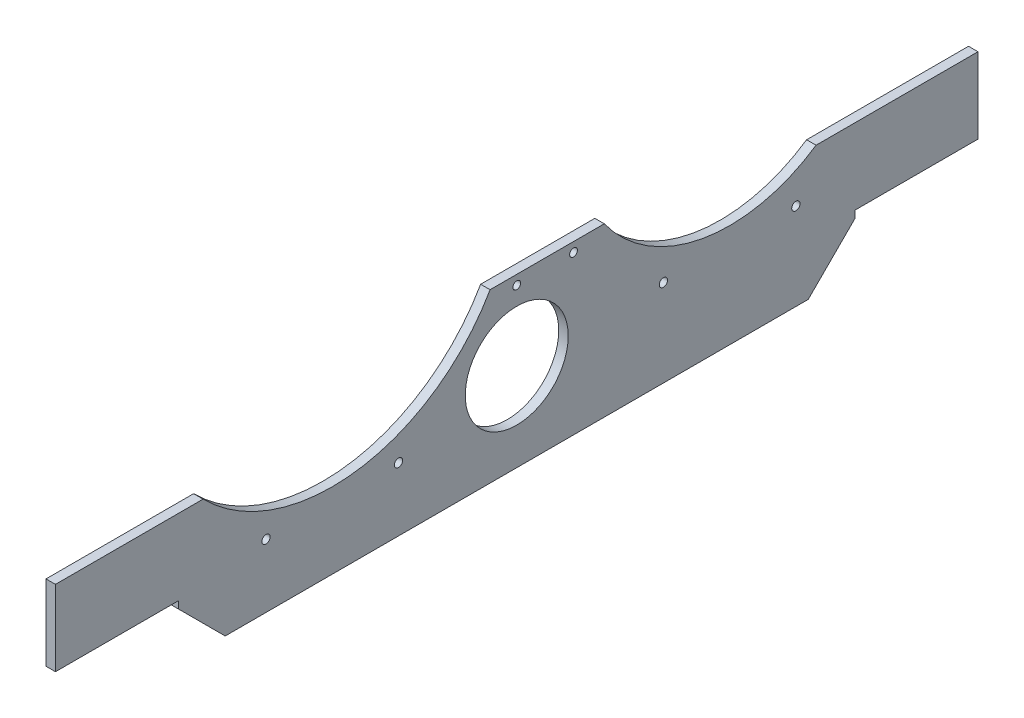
ISO-10303-21;
HEADER;
FILE_DESCRIPTION(('STEP AP214'),'2;1');
FILE_NAME('part.step','',(''),(''),'','','');
FILE_SCHEMA(('AUTOMOTIVE_DESIGN { 1 0 10303 214 1 1 1 1 }'));
ENDSEC;
DATA;
#1=APPLICATION_CONTEXT('core data for automotive mechanical design processes');
#2=APPLICATION_PROTOCOL_DEFINITION('international standard','automotive_design',2000,#1);
#3=PRODUCT_CONTEXT('',#1,'mechanical');
#4=PRODUCT('Part','Part','',(#3));
#5=PRODUCT_RELATED_PRODUCT_CATEGORY('part','',(#4));
#6=PRODUCT_DEFINITION_FORMATION('','',#4);
#7=PRODUCT_DEFINITION_CONTEXT('part definition',#1,'design');
#8=PRODUCT_DEFINITION('design','',#6,#7);
#9=PRODUCT_DEFINITION_SHAPE('','',#8);
#10=(LENGTH_UNIT() NAMED_UNIT(*) SI_UNIT(.MILLI.,.METRE.));
#11=(NAMED_UNIT(*) PLANE_ANGLE_UNIT() SI_UNIT($,.RADIAN.));
#12=(NAMED_UNIT(*) SI_UNIT($,.STERADIAN.) SOLID_ANGLE_UNIT());
#13=UNCERTAINTY_MEASURE_WITH_UNIT(LENGTH_MEASURE(1.E-05),#10,'distance_accuracy_value','');
#14=(GEOMETRIC_REPRESENTATION_CONTEXT(3) GLOBAL_UNCERTAINTY_ASSIGNED_CONTEXT((#13)) GLOBAL_UNIT_ASSIGNED_CONTEXT((#10,
#11,#12)) REPRESENTATION_CONTEXT('',''));
#15=CARTESIAN_POINT('',(0.,0.,0.));
#16=DIRECTION('',(0.,0.,1.));
#17=DIRECTION('',(1.,0.,0.));
#18=AXIS2_PLACEMENT_3D('',#15,#16,#17);
#19=CARTESIAN_POINT('',(12.7,173.99,619.125));
#20=DIRECTION('',(0.,0.,-1.));
#21=DIRECTION('',(-1.,0.,0.));
#22=AXIS2_PLACEMENT_3D('',#19,#20,#21);
#23=PLANE('',#22);
#24=DIRECTION('',(0.,-1.,0.));
#25=VECTOR('',#24,1.);
#26=CARTESIAN_POINT('',(0.,173.99,619.125));
#27=LINE('',#26,#25);
#28=CARTESIAN_POINT('',(0.,173.99,619.125));
#29=VERTEX_POINT('',#28);
#30=CARTESIAN_POINT('',(0.,72.3899999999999,619.125));
#31=VERTEX_POINT('',#30);
#32=EDGE_CURVE('E215',#29,#31,#27,.T.);
#33=ORIENTED_EDGE('',*,*,#32,.T.);
#34=DIRECTION('',(-1.,0.,0.));
#35=VECTOR('',#34,1.);
#36=CARTESIAN_POINT('',(12.7,72.3899999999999,619.125));
#37=LINE('',#36,#35);
#38=CARTESIAN_POINT('',(12.7,72.3899999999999,619.125));
#39=VERTEX_POINT('',#38);
#40=EDGE_CURVE('E11',#39,#31,#37,.T.);
#41=ORIENTED_EDGE('',*,*,#40,.F.);
#42=DIRECTION('',(0.,-1.,0.));
#43=VECTOR('',#42,1.);
#44=CARTESIAN_POINT('',(12.7,173.99,619.125));
#45=LINE('',#44,#43);
#46=CARTESIAN_POINT('',(12.7,173.99,619.125));
#47=VERTEX_POINT('',#46);
#48=EDGE_CURVE('E145',#47,#39,#45,.T.);
#49=ORIENTED_EDGE('',*,*,#48,.F.);
#50=DIRECTION('',(-1.,0.,0.));
#51=VECTOR('',#50,1.);
#52=CARTESIAN_POINT('',(12.7,173.99,619.125));
#53=LINE('',#52,#51);
#54=EDGE_CURVE('E175',#47,#29,#53,.T.);
#55=ORIENTED_EDGE('',*,*,#54,.T.);
#56=EDGE_LOOP('',(#33,#41,#49,#55));
#57=FACE_BOUND('',#56,.T.);
#58=ADVANCED_FACE('F26',(#57),#23,.F.);
#59=CARTESIAN_POINT('',(12.7,72.3899999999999,619.125));
#60=DIRECTION('',(0.,1.,0.));
#61=DIRECTION('',(0.,0.,1.));
#62=AXIS2_PLACEMENT_3D('',#59,#60,#61);
#63=PLANE('',#62);
#64=DIRECTION('',(0.,0.,-1.));
#65=VECTOR('',#64,1.);
#66=CARTESIAN_POINT('',(0.,72.3899999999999,619.125));
#67=LINE('',#66,#65);
#68=CARTESIAN_POINT('',(0.,72.3899999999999,454.025));
#69=VERTEX_POINT('',#68);
#70=EDGE_CURVE('E209',#31,#69,#67,.T.);
#71=ORIENTED_EDGE('',*,*,#70,.T.);
#72=DIRECTION('',(-1.,0.,0.));
#73=VECTOR('',#72,1.);
#74=CARTESIAN_POINT('',(12.7,72.3899999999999,454.025));
#75=LINE('',#74,#73);
#76=CARTESIAN_POINT('',(12.7,72.3899999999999,454.025));
#77=VERTEX_POINT('',#76);
#78=EDGE_CURVE('E33',#77,#69,#75,.T.);
#79=ORIENTED_EDGE('',*,*,#78,.F.);
#80=DIRECTION('',(0.,0.,-1.));
#81=VECTOR('',#80,1.);
#82=CARTESIAN_POINT('',(12.7,72.3899999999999,619.125));
#83=LINE('',#82,#81);
#84=EDGE_CURVE('E153',#39,#77,#83,.T.);
#85=ORIENTED_EDGE('',*,*,#84,.F.);
#86=ORIENTED_EDGE('',*,*,#40,.T.);
#87=EDGE_LOOP('',(#71,#79,#85,#86));
#88=FACE_BOUND('',#87,.T.);
#89=ADVANCED_FACE('F260',(#88),#63,.F.);
#90=CARTESIAN_POINT('',(12.7,72.3899999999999,454.025));
#91=DIRECTION('',(0.,0.,-1.));
#92=DIRECTION('',(-1.,0.,0.));
#93=AXIS2_PLACEMENT_3D('',#90,#91,#92);
#94=PLANE('',#93);
#95=DIRECTION('',(0.,-1.,0.));
#96=VECTOR('',#95,1.);
#97=CARTESIAN_POINT('',(0.,72.3899999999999,454.025));
#98=LINE('',#97,#96);
#99=CARTESIAN_POINT('',(0.,62.7379999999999,454.025));
#100=VERTEX_POINT('',#99);
#101=EDGE_CURVE('E205',#69,#100,#98,.T.);
#102=ORIENTED_EDGE('',*,*,#101,.T.);
#103=DIRECTION('',(-1.,0.,0.));
#104=VECTOR('',#103,1.);
#105=CARTESIAN_POINT('',(12.7,62.7379999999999,454.025));
#106=LINE('',#105,#104);
#107=CARTESIAN_POINT('',(12.7,62.7379999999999,454.025));
#108=VERTEX_POINT('',#107);
#109=EDGE_CURVE('E196',#108,#100,#106,.T.);
#110=ORIENTED_EDGE('',*,*,#109,.F.);
#111=DIRECTION('',(0.,-1.,0.));
#112=VECTOR('',#111,1.);
#113=CARTESIAN_POINT('',(12.7,72.3899999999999,454.025));
#114=LINE('',#113,#112);
#115=EDGE_CURVE('E155',#77,#108,#114,.T.);
#116=ORIENTED_EDGE('',*,*,#115,.F.);
#117=ORIENTED_EDGE('',*,*,#78,.T.);
#118=EDGE_LOOP('',(#102,#110,#116,#117));
#119=FACE_BOUND('',#118,.T.);
#120=ADVANCED_FACE('F203',(#119),#94,.F.);
#121=CARTESIAN_POINT('',(12.7,62.7379999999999,454.025));
#122=DIRECTION('',(0.,0.707106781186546,-0.707106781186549));
#123=DIRECTION('',(0.,0.707106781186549,0.707106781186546));
#124=AXIS2_PLACEMENT_3D('',#121,#122,#123);
#125=PLANE('',#124);
#126=DIRECTION('',(0.,-0.707106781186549,-0.707106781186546));
#127=VECTOR('',#126,1.);
#128=CARTESIAN_POINT('',(0.,62.7379999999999,454.025));
#129=LINE('',#128,#127);
#130=CARTESIAN_POINT('',(0.,0.,391.287));
#131=VERTEX_POINT('',#130);
#132=EDGE_CURVE('E211',#100,#131,#129,.T.);
#133=ORIENTED_EDGE('',*,*,#132,.T.);
#134=DIRECTION('',(-1.,0.,0.));
#135=VECTOR('',#134,1.);
#136=CARTESIAN_POINT('',(12.7,0.,391.287));
#137=LINE('',#136,#135);
#138=CARTESIAN_POINT('',(12.7,0.,391.287));
#139=VERTEX_POINT('',#138);
#140=EDGE_CURVE('E193',#139,#131,#137,.T.);
#141=ORIENTED_EDGE('',*,*,#140,.F.);
#142=DIRECTION('',(0.,-0.707106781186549,-0.707106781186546));
#143=VECTOR('',#142,1.);
#144=CARTESIAN_POINT('',(12.7,62.7379999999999,454.025));
#145=LINE('',#144,#143);
#146=EDGE_CURVE('E157',#108,#139,#145,.T.);
#147=ORIENTED_EDGE('',*,*,#146,.F.);
#148=ORIENTED_EDGE('',*,*,#109,.T.);
#149=EDGE_LOOP('',(#133,#141,#147,#148));
#150=FACE_BOUND('',#149,.T.);
#151=ADVANCED_FACE('F257',(#150),#125,.F.);
#152=CARTESIAN_POINT('',(12.7,0.,391.287));
#153=DIRECTION('',(0.,1.,0.));
#154=DIRECTION('',(0.,0.,1.));
#155=AXIS2_PLACEMENT_3D('',#152,#153,#154);
#156=PLANE('',#155);
#157=DIRECTION('',(0.,0.,-1.));
#158=VECTOR('',#157,1.);
#159=CARTESIAN_POINT('',(0.,0.,391.287));
#160=LINE('',#159,#158);
#161=CARTESIAN_POINT('',(0.,0.,-391.286999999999));
#162=VERTEX_POINT('',#161);
#163=EDGE_CURVE('E213',#131,#162,#160,.T.);
#164=ORIENTED_EDGE('',*,*,#163,.T.);
#165=DIRECTION('',(-1.,0.,0.));
#166=VECTOR('',#165,1.);
#167=CARTESIAN_POINT('',(12.7,0.,-391.286999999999));
#168=LINE('',#167,#166);
#169=CARTESIAN_POINT('',(12.7,0.,-391.286999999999));
#170=VERTEX_POINT('',#169);
#171=EDGE_CURVE('E190',#170,#162,#168,.T.);
#172=ORIENTED_EDGE('',*,*,#171,.F.);
#173=DIRECTION('',(0.,0.,-1.));
#174=VECTOR('',#173,1.);
#175=CARTESIAN_POINT('',(12.7,0.,391.287));
#176=LINE('',#175,#174);
#177=EDGE_CURVE('E159',#139,#170,#176,.T.);
#178=ORIENTED_EDGE('',*,*,#177,.F.);
#179=ORIENTED_EDGE('',*,*,#140,.T.);
#180=EDGE_LOOP('',(#164,#172,#178,#179));
#181=FACE_BOUND('',#180,.T.);
#182=ADVANCED_FACE('F253',(#181),#156,.F.);
#183=CARTESIAN_POINT('',(12.7,62.7379999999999,-454.025));
#184=DIRECTION('',(0.,0.707106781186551,0.707106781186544));
#185=DIRECTION('',(0.,-0.707106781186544,0.707106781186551));
#186=AXIS2_PLACEMENT_3D('',#183,#184,#185);
#187=PLANE('',#186);
#188=DIRECTION('',(0.,0.707106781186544,-0.707106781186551));
#189=VECTOR('',#188,1.);
#190=CARTESIAN_POINT('',(0.,62.7379999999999,-454.025));
#191=LINE('',#190,#189);
#192=CARTESIAN_POINT('',(0.,62.7379999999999,-454.025));
#193=VERTEX_POINT('',#192);
#194=EDGE_CURVE('E220',#162,#193,#191,.T.);
#195=ORIENTED_EDGE('',*,*,#194,.T.);
#196=DIRECTION('',(-1.,0.,0.));
#197=VECTOR('',#196,1.);
#198=CARTESIAN_POINT('',(12.7,62.7379999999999,-454.025));
#199=LINE('',#198,#197);
#200=CARTESIAN_POINT('',(12.7,62.7379999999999,-454.025));
#201=VERTEX_POINT('',#200);
#202=EDGE_CURVE('E187',#201,#193,#199,.T.);
#203=ORIENTED_EDGE('',*,*,#202,.F.);
#204=DIRECTION('',(0.,0.707106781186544,-0.707106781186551));
#205=VECTOR('',#204,1.);
#206=CARTESIAN_POINT('',(12.7,62.7379999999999,-454.025));
#207=LINE('',#206,#205);
#208=EDGE_CURVE('E161',#170,#201,#207,.T.);
#209=ORIENTED_EDGE('',*,*,#208,.F.);
#210=ORIENTED_EDGE('',*,*,#171,.T.);
#211=EDGE_LOOP('',(#195,#203,#209,#210));
#212=FACE_BOUND('',#211,.T.);
#213=ADVANCED_FACE('F249',(#212),#187,.F.);
#214=CARTESIAN_POINT('',(12.7,72.3899999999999,-454.025));
#215=DIRECTION('',(0.,0.,1.));
#216=DIRECTION('',(1.,0.,0.));
#217=AXIS2_PLACEMENT_3D('',#214,#215,#216);
#218=PLANE('',#217);
#219=DIRECTION('',(0.,1.,0.));
#220=VECTOR('',#219,1.);
#221=CARTESIAN_POINT('',(0.,72.3899999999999,-454.025));
#222=LINE('',#221,#220);
#223=CARTESIAN_POINT('',(0.,72.3899999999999,-454.025));
#224=VERTEX_POINT('',#223);
#225=EDGE_CURVE('E222',#193,#224,#222,.T.);
#226=ORIENTED_EDGE('',*,*,#225,.T.);
#227=DIRECTION('',(-1.,0.,0.));
#228=VECTOR('',#227,1.);
#229=CARTESIAN_POINT('',(12.7,72.3899999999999,-454.025));
#230=LINE('',#229,#228);
#231=CARTESIAN_POINT('',(12.7,72.3899999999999,-454.025));
#232=VERTEX_POINT('',#231);
#233=EDGE_CURVE('E184',#232,#224,#230,.T.);
#234=ORIENTED_EDGE('',*,*,#233,.F.);
#235=DIRECTION('',(0.,1.,0.));
#236=VECTOR('',#235,1.);
#237=CARTESIAN_POINT('',(12.7,72.3899999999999,-454.025));
#238=LINE('',#237,#236);
#239=EDGE_CURVE('E163',#201,#232,#238,.T.);
#240=ORIENTED_EDGE('',*,*,#239,.F.);
#241=ORIENTED_EDGE('',*,*,#202,.T.);
#242=EDGE_LOOP('',(#226,#234,#240,#241));
#243=FACE_BOUND('',#242,.T.);
#244=ADVANCED_FACE('F245',(#243),#218,.F.);
#245=CARTESIAN_POINT('',(12.7,72.3899999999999,-454.025));
#246=DIRECTION('',(0.,1.,0.));
#247=DIRECTION('',(0.,0.,1.));
#248=AXIS2_PLACEMENT_3D('',#245,#246,#247);
#249=PLANE('',#248);
#250=DIRECTION('',(0.,0.,-1.));
#251=VECTOR('',#250,1.);
#252=CARTESIAN_POINT('',(0.,72.3899999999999,-454.025));
#253=LINE('',#252,#251);
#254=CARTESIAN_POINT('',(0.,72.3899999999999,-619.125));
#255=VERTEX_POINT('',#254);
#256=EDGE_CURVE('E224',#224,#255,#253,.T.);
#257=ORIENTED_EDGE('',*,*,#256,.T.);
#258=DIRECTION('',(-1.,0.,0.));
#259=VECTOR('',#258,1.);
#260=CARTESIAN_POINT('',(12.7,72.3899999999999,-619.125));
#261=LINE('',#260,#259);
#262=CARTESIAN_POINT('',(12.7,72.3899999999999,-619.125));
#263=VERTEX_POINT('',#262);
#264=EDGE_CURVE('E181',#263,#255,#261,.T.);
#265=ORIENTED_EDGE('',*,*,#264,.F.);
#266=DIRECTION('',(0.,0.,-1.));
#267=VECTOR('',#266,1.);
#268=CARTESIAN_POINT('',(12.7,72.3899999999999,-454.025));
#269=LINE('',#268,#267);
#270=EDGE_CURVE('E165',#232,#263,#269,.T.);
#271=ORIENTED_EDGE('',*,*,#270,.F.);
#272=ORIENTED_EDGE('',*,*,#233,.T.);
#273=EDGE_LOOP('',(#257,#265,#271,#272));
#274=FACE_BOUND('',#273,.T.);
#275=ADVANCED_FACE('F241',(#274),#249,.F.);
#276=CARTESIAN_POINT('',(12.7,72.3899999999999,-619.125));
#277=DIRECTION('',(0.,0.,1.));
#278=DIRECTION('',(1.,0.,0.));
#279=AXIS2_PLACEMENT_3D('',#276,#277,#278);
#280=PLANE('',#279);
#281=DIRECTION('',(0.,1.,0.));
#282=VECTOR('',#281,1.);
#283=CARTESIAN_POINT('',(0.,72.3899999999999,-619.125));
#284=LINE('',#283,#282);
#285=CARTESIAN_POINT('',(0.,173.99,-619.125));
#286=VERTEX_POINT('',#285);
#287=EDGE_CURVE('E147',#255,#286,#284,.T.);
#288=ORIENTED_EDGE('',*,*,#287,.T.);
#289=DIRECTION('',(-1.,0.,0.));
#290=VECTOR('',#289,1.);
#291=CARTESIAN_POINT('',(12.7,173.99,-619.125));
#292=LINE('',#291,#290);
#293=CARTESIAN_POINT('',(12.7,173.99,-619.125));
#294=VERTEX_POINT('',#293);
#295=EDGE_CURVE('E178',#294,#286,#292,.T.);
#296=ORIENTED_EDGE('',*,*,#295,.F.);
#297=DIRECTION('',(0.,1.,0.));
#298=VECTOR('',#297,1.);
#299=CARTESIAN_POINT('',(12.7,72.3899999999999,-619.125));
#300=LINE('',#299,#298);
#301=EDGE_CURVE('E167',#263,#294,#300,.T.);
#302=ORIENTED_EDGE('',*,*,#301,.F.);
#303=ORIENTED_EDGE('',*,*,#264,.T.);
#304=EDGE_LOOP('',(#288,#296,#302,#303));
#305=FACE_BOUND('',#304,.T.);
#306=ADVANCED_FACE('F228',(#305),#280,.F.);
#307=CARTESIAN_POINT('',(12.7,173.99,-619.125));
#308=DIRECTION('',(0.,-1.,0.));
#309=DIRECTION('',(0.,0.,-1.));
#310=AXIS2_PLACEMENT_3D('',#307,#308,#309);
#311=PLANE('',#310);
#312=DIRECTION('',(0.,0.,1.));
#313=VECTOR('',#312,1.);
#314=CARTESIAN_POINT('',(0.,173.99,-619.125));
#315=LINE('',#314,#313);
#316=CARTESIAN_POINT('',(0.,173.99,-401.758782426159));
#317=VERTEX_POINT('',#316);
#318=EDGE_CURVE('E143',#286,#317,#315,.T.);
#319=ORIENTED_EDGE('',*,*,#318,.T.);
#320=DIRECTION('',(1.,0.,0.));
#321=VECTOR('',#320,1.);
#322=CARTESIAN_POINT('',(0.,173.99,-401.758782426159));
#323=LINE('',#322,#321);
#324=CARTESIAN_POINT('',(12.7,173.99,-401.758782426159));
#325=VERTEX_POINT('',#324);
#326=EDGE_CURVE('E40',#317,#325,#323,.T.);
#327=ORIENTED_EDGE('',*,*,#326,.T.);
#328=DIRECTION('',(0.,0.,1.));
#329=VECTOR('',#328,1.);
#330=CARTESIAN_POINT('',(12.7,173.99,-619.125));
#331=LINE('',#330,#329);
#332=EDGE_CURVE('E169',#294,#325,#331,.T.);
#333=ORIENTED_EDGE('',*,*,#332,.F.);
#334=ORIENTED_EDGE('',*,*,#295,.T.);
#335=EDGE_LOOP('',(#319,#327,#333,#334));
#336=FACE_BOUND('',#335,.T.);
#337=ADVANCED_FACE('F234',(#336),#311,.F.);
#338=CARTESIAN_POINT('',(12.7,224.79,-161.925));
#339=DIRECTION('',(0.,-1.,0.));
#340=DIRECTION('',(0.,0.,-1.));
#341=AXIS2_PLACEMENT_3D('',#338,#339,#340);
#342=PLANE('',#341);
#343=DIRECTION('',(0.,0.,1.));
#344=VECTOR('',#343,1.);
#345=CARTESIAN_POINT('',(12.7,224.79,-161.925));
#346=LINE('',#345,#344);
#347=CARTESIAN_POINT('',(12.7,224.79,-117.533717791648));
#348=VERTEX_POINT('',#347);
#349=CARTESIAN_POINT('',(12.7,224.79,35.7502050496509));
#350=VERTEX_POINT('',#349);
#351=EDGE_CURVE('E136',#348,#350,#346,.T.);
#352=ORIENTED_EDGE('',*,*,#351,.F.);
#353=DIRECTION('',(1.,0.,0.));
#354=VECTOR('',#353,1.);
#355=CARTESIAN_POINT('',(0.,224.79,-117.533717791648));
#356=LINE('',#355,#354);
#357=CARTESIAN_POINT('',(0.,224.79,-117.533717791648));
#358=VERTEX_POINT('',#357);
#359=EDGE_CURVE('E127',#348,#358,#356,.F.);
#360=ORIENTED_EDGE('',*,*,#359,.T.);
#361=DIRECTION('',(0.,0.,1.));
#362=VECTOR('',#361,1.);
#363=CARTESIAN_POINT('',(0.,224.79,-161.925));
#364=LINE('',#363,#362);
#365=CARTESIAN_POINT('',(0.,224.79,35.7502050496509));
#366=VERTEX_POINT('',#365);
#367=EDGE_CURVE('E48',#358,#366,#364,.T.);
#368=ORIENTED_EDGE('',*,*,#367,.T.);
#369=DIRECTION('',(1.,0.,0.));
#370=VECTOR('',#369,1.);
#371=CARTESIAN_POINT('',(0.,224.79,35.7502050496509));
#372=LINE('',#371,#370);
#373=EDGE_CURVE('E264',#366,#350,#372,.T.);
#374=ORIENTED_EDGE('',*,*,#373,.T.);
#375=EDGE_LOOP('',(#352,#360,#368,#374));
#376=FACE_BOUND('',#375,.T.);
#377=ADVANCED_FACE('F135',(#376),#342,.F.);
#378=CARTESIAN_POINT('',(12.7,173.99,104.775));
#379=DIRECTION('',(0.,-1.,0.));
#380=DIRECTION('',(0.,0.,-1.));
#381=AXIS2_PLACEMENT_3D('',#378,#379,#380);
#382=PLANE('',#381);
#383=DIRECTION('',(0.,0.,1.));
#384=VECTOR('',#383,1.);
#385=CARTESIAN_POINT('',(12.7,173.99,104.775));
#386=LINE('',#385,#384);
#387=CARTESIAN_POINT('',(12.7,173.99,421.036398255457));
#388=VERTEX_POINT('',#387);
#389=EDGE_CURVE('E173',#388,#47,#386,.T.);
#390=ORIENTED_EDGE('',*,*,#389,.F.);
#391=DIRECTION('',(1.,0.,0.));
#392=VECTOR('',#391,1.);
#393=CARTESIAN_POINT('',(0.,173.99,421.036398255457));
#394=LINE('',#393,#392);
#395=CARTESIAN_POINT('',(0.,173.99,421.036398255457));
#396=VERTEX_POINT('',#395);
#397=EDGE_CURVE('E265',#388,#396,#394,.F.);
#398=ORIENTED_EDGE('',*,*,#397,.T.);
#399=DIRECTION('',(0.,0.,1.));
#400=VECTOR('',#399,1.);
#401=CARTESIAN_POINT('',(0.,173.99,104.775));
#402=LINE('',#401,#400);
#403=EDGE_CURVE('E142',#396,#29,#402,.T.);
#404=ORIENTED_EDGE('',*,*,#403,.T.);
#405=ORIENTED_EDGE('',*,*,#54,.F.);
#406=EDGE_LOOP('',(#390,#398,#404,#405));
#407=FACE_BOUND('',#406,.T.);
#408=ADVANCED_FACE('F323',(#407),#382,.F.);
#409=CARTESIAN_POINT('',(12.7,72.3899999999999,619.125));
#410=DIRECTION('',(1.,0.,0.));
#411=DIRECTION('',(0.,0.,-1.));
#412=AXIS2_PLACEMENT_3D('',#409,#410,#411);
#413=PLANE('',#412);
#414=CARTESIAN_POINT('',(12.7,85.09,158.75));
#415=DIRECTION('',(1.,0.,0.));
#416=DIRECTION('',(0.,0.,-1.));
#417=AXIS2_PLACEMENT_3D('',#414,#415,#416);
#418=CIRCLE('',#417,5.54989999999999);
#419=CARTESIAN_POINT('',(12.7,85.09,153.2001));
#420=VERTEX_POINT('',#419);
#421=EDGE_CURVE('E315',#420,#420,#418,.T.);
#422=ORIENTED_EDGE('',*,*,#421,.F.);
#423=EDGE_LOOP('',(#422));
#424=FACE_BOUND('',#423,.T.);
#425=CARTESIAN_POINT('',(12.7,85.0899999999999,336.55));
#426=DIRECTION('',(1.,0.,0.));
#427=DIRECTION('',(0.,0.,-1.));
#428=AXIS2_PLACEMENT_3D('',#425,#426,#427);
#429=CIRCLE('',#428,5.54989999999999);
#430=CARTESIAN_POINT('',(12.7,85.0899999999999,331.0001));
#431=VERTEX_POINT('',#430);
#432=EDGE_CURVE('E309',#431,#431,#429,.T.);
#433=ORIENTED_EDGE('',*,*,#432,.F.);
#434=EDGE_LOOP('',(#433));
#435=FACE_BOUND('',#434,.T.);
#436=CARTESIAN_POINT('',(12.7,116.84,-374.65));
#437=DIRECTION('',(1.,0.,0.));
#438=DIRECTION('',(0.,0.,-1.));
#439=AXIS2_PLACEMENT_3D('',#436,#437,#438);
#440=CIRCLE('',#439,5.54989999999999);
#441=CARTESIAN_POINT('',(12.7,116.84,-380.1999));
#442=VERTEX_POINT('',#441);
#443=EDGE_CURVE('E303',#442,#442,#440,.T.);
#444=ORIENTED_EDGE('',*,*,#443,.F.);
#445=EDGE_LOOP('',(#444));
#446=FACE_BOUND('',#445,.T.);
#447=CARTESIAN_POINT('',(12.7,116.84,-196.85));
#448=DIRECTION('',(1.,0.,0.));
#449=DIRECTION('',(0.,0.,-1.));
#450=AXIS2_PLACEMENT_3D('',#447,#448,#449);
#451=CIRCLE('',#450,5.54989999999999);
#452=CARTESIAN_POINT('',(12.7,116.84,-202.3999));
#453=VERTEX_POINT('',#452);
#454=EDGE_CURVE('E297',#453,#453,#451,.T.);
#455=ORIENTED_EDGE('',*,*,#454,.F.);
#456=EDGE_LOOP('',(#455));
#457=FACE_BOUND('',#456,.T.);
#458=CARTESIAN_POINT('',(12.7,212.09,0.));
#459=DIRECTION('',(1.,0.,0.));
#460=DIRECTION('',(0.,0.,-1.));
#461=AXIS2_PLACEMENT_3D('',#458,#459,#460);
#462=CIRCLE('',#461,5.20700000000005);
#463=CARTESIAN_POINT('',(12.7,212.09,-5.20700000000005));
#464=VERTEX_POINT('',#463);
#465=EDGE_CURVE('E291',#464,#464,#462,.T.);
#466=ORIENTED_EDGE('',*,*,#465,.F.);
#467=EDGE_LOOP('',(#466));
#468=FACE_BOUND('',#467,.T.);
#469=CARTESIAN_POINT('',(12.7,212.09,-76.2));
#470=DIRECTION('',(1.,0.,0.));
#471=DIRECTION('',(0.,0.,-1.));
#472=AXIS2_PLACEMENT_3D('',#469,#470,#471);
#473=CIRCLE('',#472,5.20700000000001);
#474=CARTESIAN_POINT('',(12.7,212.09,-81.407));
#475=VERTEX_POINT('',#474);
#476=EDGE_CURVE('E285',#475,#475,#473,.T.);
#477=ORIENTED_EDGE('',*,*,#476,.F.);
#478=EDGE_LOOP('',(#477));
#479=FACE_BOUND('',#478,.T.);
#480=CARTESIAN_POINT('',(12.7,118.618,0.));
#481=DIRECTION('',(1.,0.,0.));
#482=DIRECTION('',(0.,0.,-1.));
#483=AXIS2_PLACEMENT_3D('',#480,#481,#482);
#484=CIRCLE('',#483,69.088);
#485=CARTESIAN_POINT('',(12.7,118.618,-69.088));
#486=VERTEX_POINT('',#485);
#487=EDGE_CURVE('E279',#486,#486,#484,.T.);
#488=ORIENTED_EDGE('',*,*,#487,.F.);
#489=EDGE_LOOP('',(#488));
#490=FACE_BOUND('',#489,.T.);
#491=CARTESIAN_POINT('',(12.7,345.44,-285.75));
#492=DIRECTION('',(1.,0.,0.));
#493=DIRECTION('',(0.,0.,-1.));
#494=AXIS2_PLACEMENT_3D('',#491,#492,#493);
#495=CIRCLE('',#494,207.01);
#496=EDGE_CURVE('E132',#348,#325,#495,.T.);
#497=ORIENTED_EDGE('',*,*,#496,.F.);
#498=ORIENTED_EDGE('',*,*,#351,.T.);
#499=CARTESIAN_POINT('',(12.7,345.44,247.65));
#500=DIRECTION('',(1.,0.,0.));
#501=DIRECTION('',(0.,0.,-1.));
#502=AXIS2_PLACEMENT_3D('',#499,#500,#501);
#503=CIRCLE('',#502,243.84);
#504=EDGE_CURVE('E271',#388,#350,#503,.T.);
#505=ORIENTED_EDGE('',*,*,#504,.F.);
#506=ORIENTED_EDGE('',*,*,#389,.T.);
#507=ORIENTED_EDGE('',*,*,#48,.T.);
#508=ORIENTED_EDGE('',*,*,#84,.T.);
#509=ORIENTED_EDGE('',*,*,#115,.T.);
#510=ORIENTED_EDGE('',*,*,#146,.T.);
#511=ORIENTED_EDGE('',*,*,#177,.T.);
#512=ORIENTED_EDGE('',*,*,#208,.T.);
#513=ORIENTED_EDGE('',*,*,#239,.T.);
#514=ORIENTED_EDGE('',*,*,#270,.T.);
#515=ORIENTED_EDGE('',*,*,#301,.T.);
#516=ORIENTED_EDGE('',*,*,#332,.T.);
#517=EDGE_LOOP('',(#497,#498,#505,#506,#507,#508,#509,#510,#511,#512,#513,#514,#515,#516));
#518=FACE_BOUND('',#517,.T.);
#519=ADVANCED_FACE('F236',(#424,#435,#446,#457,#468,#479,#490,#518),#413,.T.);
#520=CARTESIAN_POINT('',(0.,72.3899999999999,619.125));
#521=DIRECTION('',(1.,0.,0.));
#522=DIRECTION('',(0.,0.,-1.));
#523=AXIS2_PLACEMENT_3D('',#520,#521,#522);
#524=PLANE('',#523);
#525=CARTESIAN_POINT('',(0.,85.09,158.75));
#526=DIRECTION('',(1.,0.,0.));
#527=DIRECTION('',(0.,0.,-1.));
#528=AXIS2_PLACEMENT_3D('',#525,#526,#527);
#529=CIRCLE('',#528,5.54989999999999);
#530=CARTESIAN_POINT('',(0.,85.09,153.2001));
#531=VERTEX_POINT('',#530);
#532=EDGE_CURVE('E312',#531,#531,#529,.T.);
#533=ORIENTED_EDGE('',*,*,#532,.T.);
#534=EDGE_LOOP('',(#533));
#535=FACE_BOUND('',#534,.T.);
#536=CARTESIAN_POINT('',(0.,85.0899999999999,336.55));
#537=DIRECTION('',(1.,0.,0.));
#538=DIRECTION('',(0.,0.,-1.));
#539=AXIS2_PLACEMENT_3D('',#536,#537,#538);
#540=CIRCLE('',#539,5.54989999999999);
#541=CARTESIAN_POINT('',(0.,85.0899999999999,331.0001));
#542=VERTEX_POINT('',#541);
#543=EDGE_CURVE('E306',#542,#542,#540,.T.);
#544=ORIENTED_EDGE('',*,*,#543,.T.);
#545=EDGE_LOOP('',(#544));
#546=FACE_BOUND('',#545,.T.);
#547=CARTESIAN_POINT('',(0.,116.84,-374.65));
#548=DIRECTION('',(1.,0.,0.));
#549=DIRECTION('',(0.,0.,-1.));
#550=AXIS2_PLACEMENT_3D('',#547,#548,#549);
#551=CIRCLE('',#550,5.54989999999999);
#552=CARTESIAN_POINT('',(0.,116.84,-380.1999));
#553=VERTEX_POINT('',#552);
#554=EDGE_CURVE('E300',#553,#553,#551,.T.);
#555=ORIENTED_EDGE('',*,*,#554,.T.);
#556=EDGE_LOOP('',(#555));
#557=FACE_BOUND('',#556,.T.);
#558=CARTESIAN_POINT('',(0.,116.84,-196.85));
#559=DIRECTION('',(1.,0.,0.));
#560=DIRECTION('',(0.,0.,-1.));
#561=AXIS2_PLACEMENT_3D('',#558,#559,#560);
#562=CIRCLE('',#561,5.54989999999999);
#563=CARTESIAN_POINT('',(0.,116.84,-202.3999));
#564=VERTEX_POINT('',#563);
#565=EDGE_CURVE('E294',#564,#564,#562,.T.);
#566=ORIENTED_EDGE('',*,*,#565,.T.);
#567=EDGE_LOOP('',(#566));
#568=FACE_BOUND('',#567,.T.);
#569=CARTESIAN_POINT('',(0.,212.09,0.));
#570=DIRECTION('',(1.,0.,0.));
#571=DIRECTION('',(0.,0.,-1.));
#572=AXIS2_PLACEMENT_3D('',#569,#570,#571);
#573=CIRCLE('',#572,5.20700000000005);
#574=CARTESIAN_POINT('',(0.,212.09,-5.20700000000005));
#575=VERTEX_POINT('',#574);
#576=EDGE_CURVE('E288',#575,#575,#573,.T.);
#577=ORIENTED_EDGE('',*,*,#576,.T.);
#578=EDGE_LOOP('',(#577));
#579=FACE_BOUND('',#578,.T.);
#580=CARTESIAN_POINT('',(0.,212.09,-76.2));
#581=DIRECTION('',(1.,0.,0.));
#582=DIRECTION('',(0.,0.,-1.));
#583=AXIS2_PLACEMENT_3D('',#580,#581,#582);
#584=CIRCLE('',#583,5.20700000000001);
#585=CARTESIAN_POINT('',(0.,212.09,-81.407));
#586=VERTEX_POINT('',#585);
#587=EDGE_CURVE('E282',#586,#586,#584,.T.);
#588=ORIENTED_EDGE('',*,*,#587,.T.);
#589=EDGE_LOOP('',(#588));
#590=FACE_BOUND('',#589,.T.);
#591=CARTESIAN_POINT('',(0.,118.618,0.));
#592=DIRECTION('',(1.,0.,0.));
#593=DIRECTION('',(0.,0.,-1.));
#594=AXIS2_PLACEMENT_3D('',#591,#592,#593);
#595=CIRCLE('',#594,69.088);
#596=CARTESIAN_POINT('',(0.,118.618,-69.088));
#597=VERTEX_POINT('',#596);
#598=EDGE_CURVE('E276',#597,#597,#595,.T.);
#599=ORIENTED_EDGE('',*,*,#598,.T.);
#600=EDGE_LOOP('',(#599));
#601=FACE_BOUND('',#600,.T.);
#602=ORIENTED_EDGE('',*,*,#367,.F.);
#603=CARTESIAN_POINT('',(0.,345.44,-285.75));
#604=DIRECTION('',(1.,0.,0.));
#605=DIRECTION('',(0.,0.,-1.));
#606=AXIS2_PLACEMENT_3D('',#603,#604,#605);
#607=CIRCLE('',#606,207.01);
#608=EDGE_CURVE('E125',#358,#317,#607,.T.);
#609=ORIENTED_EDGE('',*,*,#608,.T.);
#610=ORIENTED_EDGE('',*,*,#318,.F.);
#611=ORIENTED_EDGE('',*,*,#287,.F.);
#612=ORIENTED_EDGE('',*,*,#256,.F.);
#613=ORIENTED_EDGE('',*,*,#225,.F.);
#614=ORIENTED_EDGE('',*,*,#194,.F.);
#615=ORIENTED_EDGE('',*,*,#163,.F.);
#616=ORIENTED_EDGE('',*,*,#132,.F.);
#617=ORIENTED_EDGE('',*,*,#101,.F.);
#618=ORIENTED_EDGE('',*,*,#70,.F.);
#619=ORIENTED_EDGE('',*,*,#32,.F.);
#620=ORIENTED_EDGE('',*,*,#403,.F.);
#621=CARTESIAN_POINT('',(0.,345.44,247.65));
#622=DIRECTION('',(1.,0.,0.));
#623=DIRECTION('',(0.,0.,-1.));
#624=AXIS2_PLACEMENT_3D('',#621,#622,#623);
#625=CIRCLE('',#624,243.84);
#626=EDGE_CURVE('E141',#396,#366,#625,.T.);
#627=ORIENTED_EDGE('',*,*,#626,.T.);
#628=EDGE_LOOP('',(#602,#609,#610,#611,#612,#613,#614,#615,#616,#617,#618,#619,#620,#627));
#629=FACE_BOUND('',#628,.T.);
#630=ADVANCED_FACE('F139',(#535,#546,#557,#568,#579,#590,#601,#629),#524,.F.);
#631=CARTESIAN_POINT('',(0.,345.44,247.65));
#632=DIRECTION('',(1.,0.,0.));
#633=DIRECTION('',(0.,0.,-1.));
#634=AXIS2_PLACEMENT_3D('',#631,#632,#633);
#635=CYLINDRICAL_SURFACE('',#634,243.84);
#636=ORIENTED_EDGE('',*,*,#626,.F.);
#637=ORIENTED_EDGE('',*,*,#397,.F.);
#638=ORIENTED_EDGE('',*,*,#504,.T.);
#639=ORIENTED_EDGE('',*,*,#373,.F.);
#640=EDGE_LOOP('',(#636,#637,#638,#639));
#641=FACE_BOUND('',#640,.T.);
#642=ADVANCED_FACE('F349',(#641),#635,.F.);
#643=CARTESIAN_POINT('',(0.,345.44,-285.75));
#644=DIRECTION('',(1.,0.,0.));
#645=DIRECTION('',(0.,0.,-1.));
#646=AXIS2_PLACEMENT_3D('',#643,#644,#645);
#647=CYLINDRICAL_SURFACE('',#646,207.01);
#648=ORIENTED_EDGE('',*,*,#608,.F.);
#649=ORIENTED_EDGE('',*,*,#359,.F.);
#650=ORIENTED_EDGE('',*,*,#496,.T.);
#651=ORIENTED_EDGE('',*,*,#326,.F.);
#652=EDGE_LOOP('',(#648,#649,#650,#651));
#653=FACE_BOUND('',#652,.T.);
#654=ADVANCED_FACE('F126',(#653),#647,.F.);
#655=CARTESIAN_POINT('',(0.,118.618,0.));
#656=DIRECTION('',(1.,0.,0.));
#657=DIRECTION('',(0.,0.,-1.));
#658=AXIS2_PLACEMENT_3D('',#655,#656,#657);
#659=CYLINDRICAL_SURFACE('',#658,69.088);
#660=ORIENTED_EDGE('',*,*,#598,.F.);
#661=EDGE_LOOP('',(#660));
#662=FACE_BOUND('',#661,.T.);
#663=ORIENTED_EDGE('',*,*,#487,.T.);
#664=EDGE_LOOP('',(#663));
#665=FACE_BOUND('',#664,.T.);
#666=ADVANCED_FACE('F337',(#662,#665),#659,.F.);
#667=CARTESIAN_POINT('',(0.,212.09,-76.2));
#668=DIRECTION('',(1.,0.,0.));
#669=DIRECTION('',(0.,0.,-1.));
#670=AXIS2_PLACEMENT_3D('',#667,#668,#669);
#671=CYLINDRICAL_SURFACE('',#670,5.20700000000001);
#672=ORIENTED_EDGE('',*,*,#587,.F.);
#673=EDGE_LOOP('',(#672));
#674=FACE_BOUND('',#673,.T.);
#675=ORIENTED_EDGE('',*,*,#476,.T.);
#676=EDGE_LOOP('',(#675));
#677=FACE_BOUND('',#676,.T.);
#678=ADVANCED_FACE('F339',(#674,#677),#671,.F.);
#679=CARTESIAN_POINT('',(0.,212.09,0.));
#680=DIRECTION('',(1.,0.,0.));
#681=DIRECTION('',(0.,0.,-1.));
#682=AXIS2_PLACEMENT_3D('',#679,#680,#681);
#683=CYLINDRICAL_SURFACE('',#682,5.20700000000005);
#684=ORIENTED_EDGE('',*,*,#576,.F.);
#685=EDGE_LOOP('',(#684));
#686=FACE_BOUND('',#685,.T.);
#687=ORIENTED_EDGE('',*,*,#465,.T.);
#688=EDGE_LOOP('',(#687));
#689=FACE_BOUND('',#688,.T.);
#690=ADVANCED_FACE('F346',(#686,#689),#683,.F.);
#691=CARTESIAN_POINT('',(0.,116.84,-196.85));
#692=DIRECTION('',(1.,0.,0.));
#693=DIRECTION('',(0.,0.,-1.));
#694=AXIS2_PLACEMENT_3D('',#691,#692,#693);
#695=CYLINDRICAL_SURFACE('',#694,5.54989999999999);
#696=ORIENTED_EDGE('',*,*,#565,.F.);
#697=EDGE_LOOP('',(#696));
#698=FACE_BOUND('',#697,.T.);
#699=ORIENTED_EDGE('',*,*,#454,.T.);
#700=EDGE_LOOP('',(#699));
#701=FACE_BOUND('',#700,.T.);
#702=ADVANCED_FACE('F409',(#698,#701),#695,.F.);
#703=CARTESIAN_POINT('',(0.,116.84,-374.65));
#704=DIRECTION('',(1.,0.,0.));
#705=DIRECTION('',(0.,0.,-1.));
#706=AXIS2_PLACEMENT_3D('',#703,#704,#705);
#707=CYLINDRICAL_SURFACE('',#706,5.54989999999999);
#708=ORIENTED_EDGE('',*,*,#554,.F.);
#709=EDGE_LOOP('',(#708));
#710=FACE_BOUND('',#709,.T.);
#711=ORIENTED_EDGE('',*,*,#443,.T.);
#712=EDGE_LOOP('',(#711));
#713=FACE_BOUND('',#712,.T.);
#714=ADVANCED_FACE('F417',(#710,#713),#707,.F.);
#715=CARTESIAN_POINT('',(0.,85.0899999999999,336.55));
#716=DIRECTION('',(1.,0.,0.));
#717=DIRECTION('',(0.,0.,-1.));
#718=AXIS2_PLACEMENT_3D('',#715,#716,#717);
#719=CYLINDRICAL_SURFACE('',#718,5.54989999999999);
#720=ORIENTED_EDGE('',*,*,#543,.F.);
#721=EDGE_LOOP('',(#720));
#722=FACE_BOUND('',#721,.T.);
#723=ORIENTED_EDGE('',*,*,#432,.T.);
#724=EDGE_LOOP('',(#723));
#725=FACE_BOUND('',#724,.T.);
#726=ADVANCED_FACE('F425',(#722,#725),#719,.F.);
#727=CARTESIAN_POINT('',(0.,85.09,158.75));
#728=DIRECTION('',(1.,0.,0.));
#729=DIRECTION('',(0.,0.,-1.));
#730=AXIS2_PLACEMENT_3D('',#727,#728,#729);
#731=CYLINDRICAL_SURFACE('',#730,5.54989999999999);
#732=ORIENTED_EDGE('',*,*,#532,.F.);
#733=EDGE_LOOP('',(#732));
#734=FACE_BOUND('',#733,.T.);
#735=ORIENTED_EDGE('',*,*,#421,.T.);
#736=EDGE_LOOP('',(#735));
#737=FACE_BOUND('',#736,.T.);
#738=ADVANCED_FACE('F319',(#734,#737),#731,.F.);
#739=CLOSED_SHELL('',(#58,#89,#120,#151,#182,#213,#244,#275,#306,#337,#377,#408,#519,#630,#642,
#654,#666,#678,#690,#702,#714,#726,#738));
#740=MANIFOLD_SOLID_BREP('B2',#739);
#741=ADVANCED_BREP_SHAPE_REPRESENTATION('',(#18,#740),#14);
#742=SHAPE_DEFINITION_REPRESENTATION(#9,#741);
ENDSEC;
END-ISO-10303-21;
